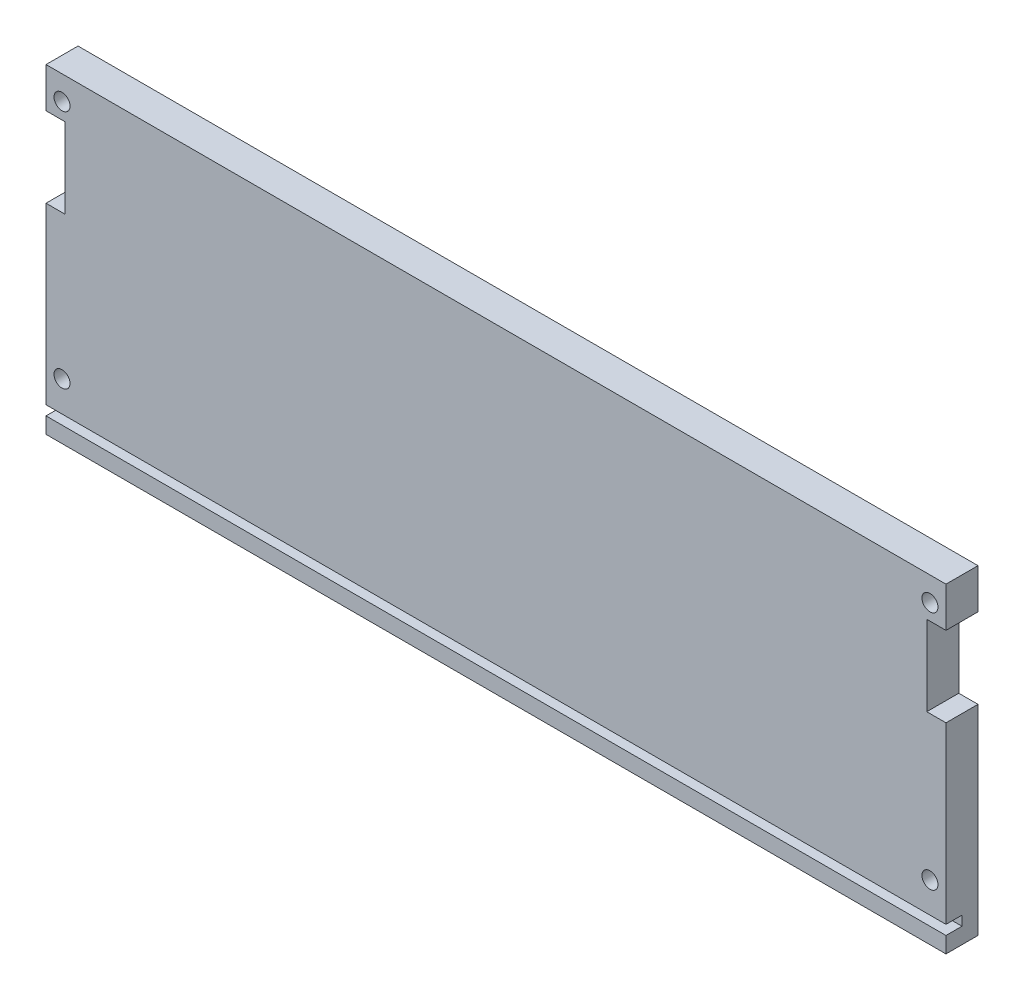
ISO-10303-21;
HEADER;
FILE_DESCRIPTION(('STEP AP214'),'2;1');
FILE_NAME('part.step','',(''),(''),'','','');
FILE_SCHEMA(('AUTOMOTIVE_DESIGN { 1 0 10303 214 1 1 1 1 }'));
ENDSEC;
DATA;
#1=APPLICATION_CONTEXT('core data for automotive mechanical design processes');
#2=APPLICATION_PROTOCOL_DEFINITION('international standard','automotive_design',2000,#1);
#3=PRODUCT_CONTEXT('',#1,'mechanical');
#4=PRODUCT('Part','Part','',(#3));
#5=PRODUCT_RELATED_PRODUCT_CATEGORY('part','',(#4));
#6=PRODUCT_DEFINITION_FORMATION('','',#4);
#7=PRODUCT_DEFINITION_CONTEXT('part definition',#1,'design');
#8=PRODUCT_DEFINITION('design','',#6,#7);
#9=PRODUCT_DEFINITION_SHAPE('','',#8);
#10=(LENGTH_UNIT() NAMED_UNIT(*) SI_UNIT(.MILLI.,.METRE.));
#11=(NAMED_UNIT(*) PLANE_ANGLE_UNIT() SI_UNIT($,.RADIAN.));
#12=(NAMED_UNIT(*) SI_UNIT($,.STERADIAN.) SOLID_ANGLE_UNIT());
#13=UNCERTAINTY_MEASURE_WITH_UNIT(LENGTH_MEASURE(1.E-05),#10,'distance_accuracy_value','');
#14=(GEOMETRIC_REPRESENTATION_CONTEXT(3) GLOBAL_UNCERTAINTY_ASSIGNED_CONTEXT((#13)) GLOBAL_UNIT_ASSIGNED_CONTEXT((#10,
#11,#12)) REPRESENTATION_CONTEXT('',''));
#15=CARTESIAN_POINT('',(0.,0.,0.));
#16=DIRECTION('',(0.,0.,1.));
#17=DIRECTION('',(1.,0.,0.));
#18=AXIS2_PLACEMENT_3D('',#15,#16,#17);
#19=CARTESIAN_POINT('',(140.5,50.,10.));
#20=DIRECTION('',(0.,0.,-1.));
#21=DIRECTION('',(-1.,0.,0.));
#22=AXIS2_PLACEMENT_3D('',#19,#20,#21);
#23=PLANE('',#22);
#24=CARTESIAN_POINT('',(-135.5,-32.5,10.));
#25=DIRECTION('',(0.,0.,1.));
#26=DIRECTION('',(1.,0.,0.));
#27=AXIS2_PLACEMENT_3D('',#24,#25,#26);
#28=CIRCLE('',#27,2.5);
#29=CARTESIAN_POINT('',(-133.,-32.5,10.));
#30=VERTEX_POINT('',#29);
#31=EDGE_CURVE('E237',#30,#30,#28,.T.);
#32=ORIENTED_EDGE('',*,*,#31,.F.);
#33=EDGE_LOOP('',(#32));
#34=FACE_BOUND('',#33,.T.);
#35=CARTESIAN_POINT('',(135.5,-32.5,10.));
#36=DIRECTION('',(0.,0.,1.));
#37=DIRECTION('',(-1.,0.,0.));
#38=AXIS2_PLACEMENT_3D('',#35,#36,#37);
#39=CIRCLE('',#38,2.5);
#40=CARTESIAN_POINT('',(133.,-32.5,10.));
#41=VERTEX_POINT('',#40);
#42=EDGE_CURVE('E231',#41,#41,#39,.T.);
#43=ORIENTED_EDGE('',*,*,#42,.F.);
#44=EDGE_LOOP('',(#43));
#45=FACE_BOUND('',#44,.T.);
#46=CARTESIAN_POINT('',(135.5,42.5,10.));
#47=DIRECTION('',(0.,0.,1.));
#48=DIRECTION('',(1.,0.,0.));
#49=AXIS2_PLACEMENT_3D('',#46,#47,#48);
#50=CIRCLE('',#49,2.5);
#51=CARTESIAN_POINT('',(138.,42.5,10.));
#52=VERTEX_POINT('',#51);
#53=EDGE_CURVE('E225',#52,#52,#50,.T.);
#54=ORIENTED_EDGE('',*,*,#53,.F.);
#55=EDGE_LOOP('',(#54));
#56=FACE_BOUND('',#55,.T.);
#57=CARTESIAN_POINT('',(-135.5,42.5,10.));
#58=DIRECTION('',(0.,0.,1.));
#59=DIRECTION('',(-1.,0.,0.));
#60=AXIS2_PLACEMENT_3D('',#57,#58,#59);
#61=CIRCLE('',#60,2.5);
#62=CARTESIAN_POINT('',(-138.,42.5,10.));
#63=VERTEX_POINT('',#62);
#64=EDGE_CURVE('E216',#63,#63,#61,.T.);
#65=ORIENTED_EDGE('',*,*,#64,.F.);
#66=EDGE_LOOP('',(#65));
#67=FACE_BOUND('',#66,.T.);
#68=DIRECTION('',(0.,-1.,0.));
#69=VECTOR('',#68,1.);
#70=CARTESIAN_POINT('',(-140.5,-50.,10.));
#71=LINE('',#70,#69);
#72=CARTESIAN_POINT('',(-140.5,12.5,10.));
#73=VERTEX_POINT('',#72);
#74=CARTESIAN_POINT('',(-140.5,-42.,10.));
#75=VERTEX_POINT('',#74);
#76=EDGE_CURVE('E257',#73,#75,#71,.T.);
#77=ORIENTED_EDGE('',*,*,#76,.T.);
#78=DIRECTION('',(-1.,0.,0.));
#79=VECTOR('',#78,1.);
#80=CARTESIAN_POINT('',(-140.5,-42.,10.));
#81=LINE('',#80,#79);
#82=CARTESIAN_POINT('',(140.5,-42.,10.));
#83=VERTEX_POINT('',#82);
#84=EDGE_CURVE('E158',#83,#75,#81,.T.);
#85=ORIENTED_EDGE('',*,*,#84,.F.);
#86=DIRECTION('',(0.,1.,0.));
#87=VECTOR('',#86,1.);
#88=CARTESIAN_POINT('',(140.5,-50.,10.));
#89=LINE('',#88,#87);
#90=CARTESIAN_POINT('',(140.5,12.5,10.));
#91=VERTEX_POINT('',#90);
#92=EDGE_CURVE('E250',#83,#91,#89,.T.);
#93=ORIENTED_EDGE('',*,*,#92,.T.);
#94=DIRECTION('',(-1.,0.,0.));
#95=VECTOR('',#94,1.);
#96=CARTESIAN_POINT('',(140.5,12.5,10.));
#97=LINE('',#96,#95);
#98=CARTESIAN_POINT('',(134.5,12.5,10.));
#99=VERTEX_POINT('',#98);
#100=EDGE_CURVE('E196',#91,#99,#97,.T.);
#101=ORIENTED_EDGE('',*,*,#100,.T.);
#102=DIRECTION('',(0.,1.,0.));
#103=VECTOR('',#102,1.);
#104=CARTESIAN_POINT('',(134.5,37.5,10.));
#105=LINE('',#104,#103);
#106=CARTESIAN_POINT('',(134.5,37.5,10.));
#107=VERTEX_POINT('',#106);
#108=EDGE_CURVE('E199',#99,#107,#105,.T.);
#109=ORIENTED_EDGE('',*,*,#108,.T.);
#110=DIRECTION('',(1.,0.,0.));
#111=VECTOR('',#110,1.);
#112=CARTESIAN_POINT('',(140.5,37.5,10.));
#113=LINE('',#112,#111);
#114=CARTESIAN_POINT('',(140.5,37.5,10.));
#115=VERTEX_POINT('',#114);
#116=EDGE_CURVE('E203',#107,#115,#113,.T.);
#117=ORIENTED_EDGE('',*,*,#116,.T.);
#118=CARTESIAN_POINT('',(140.5,50.,10.));
#119=VERTEX_POINT('',#118);
#120=EDGE_CURVE('E251',#115,#119,#89,.T.);
#121=ORIENTED_EDGE('',*,*,#120,.T.);
#122=DIRECTION('',(-1.,0.,0.));
#123=VECTOR('',#122,1.);
#124=CARTESIAN_POINT('',(-140.5,50.,10.));
#125=LINE('',#124,#123);
#126=CARTESIAN_POINT('',(-140.5,50.,10.));
#127=VERTEX_POINT('',#126);
#128=EDGE_CURVE('E249',#119,#127,#125,.T.);
#129=ORIENTED_EDGE('',*,*,#128,.T.);
#130=CARTESIAN_POINT('',(-140.5,37.5,10.));
#131=VERTEX_POINT('',#130);
#132=EDGE_CURVE('E253',#127,#131,#71,.T.);
#133=ORIENTED_EDGE('',*,*,#132,.T.);
#134=DIRECTION('',(1.,0.,0.));
#135=VECTOR('',#134,1.);
#136=CARTESIAN_POINT('',(-140.5,37.5,10.));
#137=LINE('',#136,#135);
#138=CARTESIAN_POINT('',(-134.5,37.5,10.));
#139=VERTEX_POINT('',#138);
#140=EDGE_CURVE('E170',#131,#139,#137,.T.);
#141=ORIENTED_EDGE('',*,*,#140,.T.);
#142=DIRECTION('',(0.,-1.,0.));
#143=VECTOR('',#142,1.);
#144=CARTESIAN_POINT('',(-134.5,37.5,10.));
#145=LINE('',#144,#143);
#146=CARTESIAN_POINT('',(-134.5,12.5,10.));
#147=VERTEX_POINT('',#146);
#148=EDGE_CURVE('E173',#139,#147,#145,.T.);
#149=ORIENTED_EDGE('',*,*,#148,.T.);
#150=DIRECTION('',(-1.,0.,0.));
#151=VECTOR('',#150,1.);
#152=CARTESIAN_POINT('',(-140.5,12.5,10.));
#153=LINE('',#152,#151);
#154=EDGE_CURVE('E177',#147,#73,#153,.T.);
#155=ORIENTED_EDGE('',*,*,#154,.T.);
#156=EDGE_LOOP('',(#77,#85,#93,#101,#109,#117,#121,#129,#133,#141,#149,#155));
#157=FACE_BOUND('',#156,.T.);
#158=ADVANCED_FACE('F30',(#34,#45,#56,#67,#157),#23,.F.);
#159=CARTESIAN_POINT('',(-140.5,-50.,10.));
#160=DIRECTION('',(1.,0.,0.));
#161=DIRECTION('',(0.,0.,-1.));
#162=AXIS2_PLACEMENT_3D('',#159,#160,#161);
#163=PLANE('',#162);
#164=DIRECTION('',(0.,-1.,0.));
#165=VECTOR('',#164,1.);
#166=CARTESIAN_POINT('',(-140.5,-50.,0.));
#167=LINE('',#166,#165);
#168=CARTESIAN_POINT('',(-140.5,50.,0.));
#169=VERTEX_POINT('',#168);
#170=CARTESIAN_POINT('',(-140.5,37.5,0.));
#171=VERTEX_POINT('',#170);
#172=EDGE_CURVE('E266',#169,#171,#167,.T.);
#173=ORIENTED_EDGE('',*,*,#172,.T.);
#174=DIRECTION('',(0.,0.,-1.));
#175=VECTOR('',#174,1.);
#176=CARTESIAN_POINT('',(-140.5,37.5,10.));
#177=LINE('',#176,#175);
#178=EDGE_CURVE('E187',#131,#171,#177,.T.);
#179=ORIENTED_EDGE('',*,*,#178,.F.);
#180=ORIENTED_EDGE('',*,*,#132,.F.);
#181=DIRECTION('',(0.,0.,-1.));
#182=VECTOR('',#181,1.);
#183=CARTESIAN_POINT('',(-140.5,50.,10.));
#184=LINE('',#183,#182);
#185=EDGE_CURVE('E38',#127,#169,#184,.T.);
#186=ORIENTED_EDGE('',*,*,#185,.T.);
#187=EDGE_LOOP('',(#173,#179,#180,#186));
#188=FACE_BOUND('',#187,.T.);
#189=ADVANCED_FACE('F280',(#188),#163,.F.);
#190=CARTESIAN_POINT('',(140.5,-50.,10.));
#191=DIRECTION('',(-1.,0.,0.));
#192=DIRECTION('',(0.,0.,1.));
#193=AXIS2_PLACEMENT_3D('',#190,#191,#192);
#194=PLANE('',#193);
#195=ORIENTED_EDGE('',*,*,#120,.F.);
#196=DIRECTION('',(0.,0.,-1.));
#197=VECTOR('',#196,1.);
#198=CARTESIAN_POINT('',(140.5,37.5,10.));
#199=LINE('',#198,#197);
#200=CARTESIAN_POINT('',(140.5,37.5,0.));
#201=VERTEX_POINT('',#200);
#202=EDGE_CURVE('E213',#115,#201,#199,.T.);
#203=ORIENTED_EDGE('',*,*,#202,.T.);
#204=DIRECTION('',(0.,1.,0.));
#205=VECTOR('',#204,1.);
#206=CARTESIAN_POINT('',(140.5,-50.,0.));
#207=LINE('',#206,#205);
#208=CARTESIAN_POINT('',(140.5,50.,0.));
#209=VERTEX_POINT('',#208);
#210=EDGE_CURVE('E243',#201,#209,#207,.T.);
#211=ORIENTED_EDGE('',*,*,#210,.T.);
#212=DIRECTION('',(0.,0.,-1.));
#213=VECTOR('',#212,1.);
#214=CARTESIAN_POINT('',(140.5,50.,10.));
#215=LINE('',#214,#213);
#216=EDGE_CURVE('E11',#119,#209,#215,.T.);
#217=ORIENTED_EDGE('',*,*,#216,.F.);
#218=EDGE_LOOP('',(#195,#203,#211,#217));
#219=FACE_BOUND('',#218,.T.);
#220=ADVANCED_FACE('F302',(#219),#194,.F.);
#221=ORIENTED_EDGE('',*,*,#92,.F.);
#222=DIRECTION('',(0.,0.,1.));
#223=VECTOR('',#222,1.);
#224=CARTESIAN_POINT('',(140.5,-42.,5.));
#225=LINE('',#224,#223);
#226=CARTESIAN_POINT('',(140.5,-42.,5.));
#227=VERTEX_POINT('',#226);
#228=EDGE_CURVE('E165',#227,#83,#225,.T.);
#229=ORIENTED_EDGE('',*,*,#228,.F.);
#230=DIRECTION('',(0.,1.,0.));
#231=VECTOR('',#230,1.);
#232=CARTESIAN_POINT('',(140.5,-42.,5.));
#233=LINE('',#232,#231);
#234=CARTESIAN_POINT('',(140.5,-45.,5.));
#235=VERTEX_POINT('',#234);
#236=EDGE_CURVE('E148',#235,#227,#233,.T.);
#237=ORIENTED_EDGE('',*,*,#236,.F.);
#238=DIRECTION('',(0.,0.,1.));
#239=VECTOR('',#238,1.);
#240=CARTESIAN_POINT('',(140.5,-45.,5.));
#241=LINE('',#240,#239);
#242=CARTESIAN_POINT('',(140.5,-45.,10.));
#243=VERTEX_POINT('',#242);
#244=EDGE_CURVE('E145',#235,#243,#241,.T.);
#245=ORIENTED_EDGE('',*,*,#244,.T.);
#246=CARTESIAN_POINT('',(140.5,-50.,10.));
#247=VERTEX_POINT('',#246);
#248=EDGE_CURVE('E246',#247,#243,#89,.T.);
#249=ORIENTED_EDGE('',*,*,#248,.F.);
#250=DIRECTION('',(0.,0.,-1.));
#251=VECTOR('',#250,1.);
#252=CARTESIAN_POINT('',(140.5,-50.,10.));
#253=LINE('',#252,#251);
#254=CARTESIAN_POINT('',(140.5,-50.,0.));
#255=VERTEX_POINT('',#254);
#256=EDGE_CURVE('E259',#247,#255,#253,.T.);
#257=ORIENTED_EDGE('',*,*,#256,.T.);
#258=CARTESIAN_POINT('',(140.5,12.5,0.));
#259=VERTEX_POINT('',#258);
#260=EDGE_CURVE('E260',#255,#259,#207,.T.);
#261=ORIENTED_EDGE('',*,*,#260,.T.);
#262=DIRECTION('',(0.,0.,-1.));
#263=VECTOR('',#262,1.);
#264=CARTESIAN_POINT('',(140.5,12.5,10.));
#265=LINE('',#264,#263);
#266=EDGE_CURVE('E206',#91,#259,#265,.T.);
#267=ORIENTED_EDGE('',*,*,#266,.F.);
#268=EDGE_LOOP('',(#221,#229,#237,#245,#249,#257,#261,#267));
#269=FACE_BOUND('',#268,.T.);
#270=ADVANCED_FACE('F32',(#269),#194,.F.);
#271=CARTESIAN_POINT('',(-140.5,50.,10.));
#272=DIRECTION('',(0.,-1.,0.));
#273=DIRECTION('',(0.,0.,-1.));
#274=AXIS2_PLACEMENT_3D('',#271,#272,#273);
#275=PLANE('',#274);
#276=DIRECTION('',(-1.,0.,0.));
#277=VECTOR('',#276,1.);
#278=CARTESIAN_POINT('',(-140.5,50.,0.));
#279=LINE('',#278,#277);
#280=EDGE_CURVE('E263',#209,#169,#279,.T.);
#281=ORIENTED_EDGE('',*,*,#280,.T.);
#282=ORIENTED_EDGE('',*,*,#185,.F.);
#283=ORIENTED_EDGE('',*,*,#128,.F.);
#284=ORIENTED_EDGE('',*,*,#216,.T.);
#285=EDGE_LOOP('',(#281,#282,#283,#284));
#286=FACE_BOUND('',#285,.T.);
#287=ADVANCED_FACE('F300',(#286),#275,.F.);
#288=DIRECTION('',(0.,-1.,0.));
#289=VECTOR('',#288,1.);
#290=CARTESIAN_POINT('',(-140.5,-42.,5.));
#291=LINE('',#290,#289);
#292=CARTESIAN_POINT('',(-140.5,-42.,5.));
#293=VERTEX_POINT('',#292);
#294=CARTESIAN_POINT('',(-140.5,-45.,5.));
#295=VERTEX_POINT('',#294);
#296=EDGE_CURVE('E149',#293,#295,#291,.T.);
#297=ORIENTED_EDGE('',*,*,#296,.F.);
#298=DIRECTION('',(0.,0.,1.));
#299=VECTOR('',#298,1.);
#300=CARTESIAN_POINT('',(-140.5,-42.,5.));
#301=LINE('',#300,#299);
#302=EDGE_CURVE('E183',#293,#75,#301,.T.);
#303=ORIENTED_EDGE('',*,*,#302,.T.);
#304=ORIENTED_EDGE('',*,*,#76,.F.);
#305=DIRECTION('',(0.,0.,-1.));
#306=VECTOR('',#305,1.);
#307=CARTESIAN_POINT('',(-140.5,12.5,10.));
#308=LINE('',#307,#306);
#309=CARTESIAN_POINT('',(-140.5,12.5,0.));
#310=VERTEX_POINT('',#309);
#311=EDGE_CURVE('E190',#73,#310,#308,.T.);
#312=ORIENTED_EDGE('',*,*,#311,.T.);
#313=CARTESIAN_POINT('',(-140.5,-50.,0.));
#314=VERTEX_POINT('',#313);
#315=EDGE_CURVE('E265',#310,#314,#167,.T.);
#316=ORIENTED_EDGE('',*,*,#315,.T.);
#317=DIRECTION('',(0.,0.,-1.));
#318=VECTOR('',#317,1.);
#319=CARTESIAN_POINT('',(-140.5,-50.,10.));
#320=LINE('',#319,#318);
#321=CARTESIAN_POINT('',(-140.5,-50.,10.));
#322=VERTEX_POINT('',#321);
#323=EDGE_CURVE('E273',#322,#314,#320,.T.);
#324=ORIENTED_EDGE('',*,*,#323,.F.);
#325=CARTESIAN_POINT('',(-140.5,-45.,10.));
#326=VERTEX_POINT('',#325);
#327=EDGE_CURVE('E163',#326,#322,#71,.T.);
#328=ORIENTED_EDGE('',*,*,#327,.F.);
#329=DIRECTION('',(0.,0.,1.));
#330=VECTOR('',#329,1.);
#331=CARTESIAN_POINT('',(-140.5,-45.,5.));
#332=LINE('',#331,#330);
#333=EDGE_CURVE('E45',#295,#326,#332,.T.);
#334=ORIENTED_EDGE('',*,*,#333,.F.);
#335=EDGE_LOOP('',(#297,#303,#304,#312,#316,#324,#328,#334));
#336=FACE_BOUND('',#335,.T.);
#337=ADVANCED_FACE('F161',(#336),#163,.F.);
#338=CARTESIAN_POINT('',(-140.5,-50.,10.));
#339=DIRECTION('',(0.,1.,0.));
#340=DIRECTION('',(0.,0.,1.));
#341=AXIS2_PLACEMENT_3D('',#338,#339,#340);
#342=PLANE('',#341);
#343=DIRECTION('',(1.,0.,0.));
#344=VECTOR('',#343,1.);
#345=CARTESIAN_POINT('',(-140.5,-50.,0.));
#346=LINE('',#345,#344);
#347=EDGE_CURVE('E269',#314,#255,#346,.T.);
#348=ORIENTED_EDGE('',*,*,#347,.T.);
#349=ORIENTED_EDGE('',*,*,#256,.F.);
#350=DIRECTION('',(1.,0.,0.));
#351=VECTOR('',#350,1.);
#352=CARTESIAN_POINT('',(-140.5,-50.,10.));
#353=LINE('',#352,#351);
#354=EDGE_CURVE('E256',#322,#247,#353,.T.);
#355=ORIENTED_EDGE('',*,*,#354,.F.);
#356=ORIENTED_EDGE('',*,*,#323,.T.);
#357=EDGE_LOOP('',(#348,#349,#355,#356));
#358=FACE_BOUND('',#357,.T.);
#359=ADVANCED_FACE('F324',(#358),#342,.F.);
#360=ORIENTED_EDGE('',*,*,#248,.T.);
#361=DIRECTION('',(1.,0.,0.));
#362=VECTOR('',#361,1.);
#363=CARTESIAN_POINT('',(-140.5,-45.,10.));
#364=LINE('',#363,#362);
#365=EDGE_CURVE('E331',#326,#243,#364,.T.);
#366=ORIENTED_EDGE('',*,*,#365,.F.);
#367=ORIENTED_EDGE('',*,*,#327,.T.);
#368=ORIENTED_EDGE('',*,*,#354,.T.);
#369=EDGE_LOOP('',(#360,#366,#367,#368));
#370=FACE_BOUND('',#369,.T.);
#371=ADVANCED_FACE('F330',(#370),#23,.F.);
#372=CARTESIAN_POINT('',(140.5,50.,0.));
#373=DIRECTION('',(0.,0.,-1.));
#374=DIRECTION('',(-1.,0.,0.));
#375=AXIS2_PLACEMENT_3D('',#372,#373,#374);
#376=PLANE('',#375);
#377=DIRECTION('',(1.,0.,0.));
#378=VECTOR('',#377,1.);
#379=CARTESIAN_POINT('',(-140.5,37.5,0.));
#380=LINE('',#379,#378);
#381=CARTESIAN_POINT('',(-134.5,37.5,0.));
#382=VERTEX_POINT('',#381);
#383=EDGE_CURVE('E53',#171,#382,#380,.T.);
#384=ORIENTED_EDGE('',*,*,#383,.F.);
#385=ORIENTED_EDGE('',*,*,#172,.F.);
#386=ORIENTED_EDGE('',*,*,#280,.F.);
#387=ORIENTED_EDGE('',*,*,#210,.F.);
#388=DIRECTION('',(1.,0.,0.));
#389=VECTOR('',#388,1.);
#390=CARTESIAN_POINT('',(140.5,37.5,0.));
#391=LINE('',#390,#389);
#392=CARTESIAN_POINT('',(134.5,37.5,0.));
#393=VERTEX_POINT('',#392);
#394=EDGE_CURVE('E200',#393,#201,#391,.T.);
#395=ORIENTED_EDGE('',*,*,#394,.F.);
#396=DIRECTION('',(0.,1.,0.));
#397=VECTOR('',#396,1.);
#398=CARTESIAN_POINT('',(134.5,37.5,0.));
#399=LINE('',#398,#397);
#400=CARTESIAN_POINT('',(134.5,12.5,0.));
#401=VERTEX_POINT('',#400);
#402=EDGE_CURVE('E209',#401,#393,#399,.T.);
#403=ORIENTED_EDGE('',*,*,#402,.F.);
#404=DIRECTION('',(-1.,0.,0.));
#405=VECTOR('',#404,1.);
#406=CARTESIAN_POINT('',(140.5,12.5,0.));
#407=LINE('',#406,#405);
#408=EDGE_CURVE('E189',#259,#401,#407,.T.);
#409=ORIENTED_EDGE('',*,*,#408,.F.);
#410=ORIENTED_EDGE('',*,*,#260,.F.);
#411=ORIENTED_EDGE('',*,*,#347,.F.);
#412=ORIENTED_EDGE('',*,*,#315,.F.);
#413=DIRECTION('',(-1.,0.,0.));
#414=VECTOR('',#413,1.);
#415=CARTESIAN_POINT('',(-140.5,12.5,0.));
#416=LINE('',#415,#414);
#417=CARTESIAN_POINT('',(-134.5,12.5,0.));
#418=VERTEX_POINT('',#417);
#419=EDGE_CURVE('E174',#418,#310,#416,.T.);
#420=ORIENTED_EDGE('',*,*,#419,.F.);
#421=DIRECTION('',(0.,-1.,0.));
#422=VECTOR('',#421,1.);
#423=CARTESIAN_POINT('',(-134.5,37.5,0.));
#424=LINE('',#423,#422);
#425=EDGE_CURVE('E182',#382,#418,#424,.T.);
#426=ORIENTED_EDGE('',*,*,#425,.F.);
#427=EDGE_LOOP('',(#384,#385,#386,#387,#395,#403,#409,#410,#411,#412,#420,#426));
#428=FACE_BOUND('',#427,.T.);
#429=ADVANCED_FACE('F286',(#428),#376,.T.);
#430=CARTESIAN_POINT('',(-135.5,-32.5,5.));
#431=DIRECTION('',(0.,0.,1.));
#432=DIRECTION('',(1.,0.,0.));
#433=AXIS2_PLACEMENT_3D('',#430,#431,#432);
#434=CYLINDRICAL_SURFACE('',#433,2.5);
#435=CARTESIAN_POINT('',(-135.5,-32.5,5.));
#436=DIRECTION('',(0.,0.,1.));
#437=DIRECTION('',(1.,0.,0.));
#438=AXIS2_PLACEMENT_3D('',#435,#436,#437);
#439=CIRCLE('',#438,2.5);
#440=CARTESIAN_POINT('',(-133.,-32.5,5.));
#441=VERTEX_POINT('',#440);
#442=EDGE_CURVE('E240',#441,#441,#439,.T.);
#443=ORIENTED_EDGE('',*,*,#442,.F.);
#444=EDGE_LOOP('',(#443));
#445=FACE_BOUND('',#444,.T.);
#446=ORIENTED_EDGE('',*,*,#31,.T.);
#447=EDGE_LOOP('',(#446));
#448=FACE_BOUND('',#447,.T.);
#449=ADVANCED_FACE('F364',(#445,#448),#434,.F.);
#450=CARTESIAN_POINT('',(-135.5,-32.5,5.));
#451=DIRECTION('',(0.,0.,1.));
#452=DIRECTION('',(1.,0.,0.));
#453=AXIS2_PLACEMENT_3D('',#450,#451,#452);
#454=PLANE('',#453);
#455=ORIENTED_EDGE('',*,*,#442,.T.);
#456=EDGE_LOOP('',(#455));
#457=FACE_BOUND('',#456,.T.);
#458=ADVANCED_FACE('F445',(#457),#454,.T.);
#459=CARTESIAN_POINT('',(135.5,-32.5,5.));
#460=DIRECTION('',(0.,0.,1.));
#461=DIRECTION('',(1.,0.,0.));
#462=AXIS2_PLACEMENT_3D('',#459,#460,#461);
#463=CYLINDRICAL_SURFACE('',#462,2.5);
#464=CARTESIAN_POINT('',(135.5,-32.5,5.));
#465=DIRECTION('',(0.,0.,1.));
#466=DIRECTION('',(-1.,0.,0.));
#467=AXIS2_PLACEMENT_3D('',#464,#465,#466);
#468=CIRCLE('',#467,2.5);
#469=CARTESIAN_POINT('',(133.,-32.5,5.));
#470=VERTEX_POINT('',#469);
#471=EDGE_CURVE('E234',#470,#470,#468,.T.);
#472=ORIENTED_EDGE('',*,*,#471,.F.);
#473=EDGE_LOOP('',(#472));
#474=FACE_BOUND('',#473,.T.);
#475=ORIENTED_EDGE('',*,*,#42,.T.);
#476=EDGE_LOOP('',(#475));
#477=FACE_BOUND('',#476,.T.);
#478=ADVANCED_FACE('F435',(#474,#477),#463,.F.);
#479=CARTESIAN_POINT('',(135.5,-32.5,5.));
#480=DIRECTION('',(0.,0.,-1.));
#481=DIRECTION('',(-1.,0.,0.));
#482=AXIS2_PLACEMENT_3D('',#479,#480,#481);
#483=PLANE('',#482);
#484=ORIENTED_EDGE('',*,*,#471,.T.);
#485=EDGE_LOOP('',(#484));
#486=FACE_BOUND('',#485,.T.);
#487=ADVANCED_FACE('F425',(#486),#483,.F.);
#488=CARTESIAN_POINT('',(135.5,42.5,5.));
#489=DIRECTION('',(0.,0.,1.));
#490=DIRECTION('',(1.,0.,0.));
#491=AXIS2_PLACEMENT_3D('',#488,#489,#490);
#492=CYLINDRICAL_SURFACE('',#491,2.5);
#493=CARTESIAN_POINT('',(135.5,42.5,5.));
#494=DIRECTION('',(0.,0.,1.));
#495=DIRECTION('',(1.,0.,0.));
#496=AXIS2_PLACEMENT_3D('',#493,#494,#495);
#497=CIRCLE('',#496,2.5);
#498=CARTESIAN_POINT('',(138.,42.5,5.));
#499=VERTEX_POINT('',#498);
#500=EDGE_CURVE('E228',#499,#499,#497,.T.);
#501=ORIENTED_EDGE('',*,*,#500,.F.);
#502=EDGE_LOOP('',(#501));
#503=FACE_BOUND('',#502,.T.);
#504=ORIENTED_EDGE('',*,*,#53,.T.);
#505=EDGE_LOOP('',(#504));
#506=FACE_BOUND('',#505,.T.);
#507=ADVANCED_FACE('F415',(#503,#506),#492,.F.);
#508=CARTESIAN_POINT('',(135.5,42.5,5.));
#509=DIRECTION('',(0.,0.,1.));
#510=DIRECTION('',(1.,0.,0.));
#511=AXIS2_PLACEMENT_3D('',#508,#509,#510);
#512=PLANE('',#511);
#513=ORIENTED_EDGE('',*,*,#500,.T.);
#514=EDGE_LOOP('',(#513));
#515=FACE_BOUND('',#514,.T.);
#516=ADVANCED_FACE('F405',(#515),#512,.T.);
#517=CARTESIAN_POINT('',(-135.5,42.5,5.));
#518=DIRECTION('',(0.,0.,1.));
#519=DIRECTION('',(1.,0.,0.));
#520=AXIS2_PLACEMENT_3D('',#517,#518,#519);
#521=CYLINDRICAL_SURFACE('',#520,2.5);
#522=CARTESIAN_POINT('',(-135.5,42.5,5.));
#523=DIRECTION('',(0.,0.,1.));
#524=DIRECTION('',(-1.,0.,0.));
#525=AXIS2_PLACEMENT_3D('',#522,#523,#524);
#526=CIRCLE('',#525,2.5);
#527=CARTESIAN_POINT('',(-138.,42.5,5.));
#528=VERTEX_POINT('',#527);
#529=EDGE_CURVE('E222',#528,#528,#526,.T.);
#530=ORIENTED_EDGE('',*,*,#529,.F.);
#531=EDGE_LOOP('',(#530));
#532=FACE_BOUND('',#531,.T.);
#533=ORIENTED_EDGE('',*,*,#64,.T.);
#534=EDGE_LOOP('',(#533));
#535=FACE_BOUND('',#534,.T.);
#536=ADVANCED_FACE('F394',(#532,#535),#521,.F.);
#537=CARTESIAN_POINT('',(-135.5,42.5,5.));
#538=DIRECTION('',(0.,0.,-1.));
#539=DIRECTION('',(-1.,0.,0.));
#540=AXIS2_PLACEMENT_3D('',#537,#538,#539);
#541=PLANE('',#540);
#542=ORIENTED_EDGE('',*,*,#529,.T.);
#543=EDGE_LOOP('',(#542));
#544=FACE_BOUND('',#543,.T.);
#545=ADVANCED_FACE('F389',(#544),#541,.F.);
#546=CARTESIAN_POINT('',(140.5,37.5,10.));
#547=DIRECTION('',(0.,1.,0.));
#548=DIRECTION('',(0.,0.,1.));
#549=AXIS2_PLACEMENT_3D('',#546,#547,#548);
#550=PLANE('',#549);
#551=ORIENTED_EDGE('',*,*,#394,.T.);
#552=ORIENTED_EDGE('',*,*,#202,.F.);
#553=ORIENTED_EDGE('',*,*,#116,.F.);
#554=DIRECTION('',(0.,0.,-1.));
#555=VECTOR('',#554,1.);
#556=CARTESIAN_POINT('',(134.5,37.5,10.));
#557=LINE('',#556,#555);
#558=EDGE_CURVE('E217',#107,#393,#557,.T.);
#559=ORIENTED_EDGE('',*,*,#558,.T.);
#560=EDGE_LOOP('',(#551,#552,#553,#559));
#561=FACE_BOUND('',#560,.T.);
#562=ADVANCED_FACE('F307',(#561),#550,.F.);
#563=CARTESIAN_POINT('',(134.5,37.5,10.));
#564=DIRECTION('',(-1.,0.,0.));
#565=DIRECTION('',(0.,0.,1.));
#566=AXIS2_PLACEMENT_3D('',#563,#564,#565);
#567=PLANE('',#566);
#568=ORIENTED_EDGE('',*,*,#402,.T.);
#569=ORIENTED_EDGE('',*,*,#558,.F.);
#570=ORIENTED_EDGE('',*,*,#108,.F.);
#571=DIRECTION('',(0.,0.,-1.));
#572=VECTOR('',#571,1.);
#573=CARTESIAN_POINT('',(134.5,12.5,10.));
#574=LINE('',#573,#572);
#575=EDGE_CURVE('E219',#99,#401,#574,.T.);
#576=ORIENTED_EDGE('',*,*,#575,.T.);
#577=EDGE_LOOP('',(#568,#569,#570,#576));
#578=FACE_BOUND('',#577,.T.);
#579=ADVANCED_FACE('F311',(#578),#567,.F.);
#580=CARTESIAN_POINT('',(140.5,12.5,10.));
#581=DIRECTION('',(0.,-1.,0.));
#582=DIRECTION('',(0.,0.,-1.));
#583=AXIS2_PLACEMENT_3D('',#580,#581,#582);
#584=PLANE('',#583);
#585=ORIENTED_EDGE('',*,*,#408,.T.);
#586=ORIENTED_EDGE('',*,*,#575,.F.);
#587=ORIENTED_EDGE('',*,*,#100,.F.);
#588=ORIENTED_EDGE('',*,*,#266,.T.);
#589=EDGE_LOOP('',(#585,#586,#587,#588));
#590=FACE_BOUND('',#589,.T.);
#591=ADVANCED_FACE('F314',(#590),#584,.F.);
#592=CARTESIAN_POINT('',(-140.5,37.5,10.));
#593=DIRECTION('',(0.,1.,0.));
#594=DIRECTION('',(0.,0.,1.));
#595=AXIS2_PLACEMENT_3D('',#592,#593,#594);
#596=PLANE('',#595);
#597=ORIENTED_EDGE('',*,*,#383,.T.);
#598=DIRECTION('',(0.,0.,-1.));
#599=VECTOR('',#598,1.);
#600=CARTESIAN_POINT('',(-134.5,37.5,10.));
#601=LINE('',#600,#599);
#602=EDGE_CURVE('E180',#139,#382,#601,.T.);
#603=ORIENTED_EDGE('',*,*,#602,.F.);
#604=ORIENTED_EDGE('',*,*,#140,.F.);
#605=ORIENTED_EDGE('',*,*,#178,.T.);
#606=EDGE_LOOP('',(#597,#603,#604,#605));
#607=FACE_BOUND('',#606,.T.);
#608=ADVANCED_FACE('F295',(#607),#596,.F.);
#609=CARTESIAN_POINT('',(-140.5,12.5,10.));
#610=DIRECTION('',(0.,-1.,0.));
#611=DIRECTION('',(0.,0.,-1.));
#612=AXIS2_PLACEMENT_3D('',#609,#610,#611);
#613=PLANE('',#612);
#614=ORIENTED_EDGE('',*,*,#419,.T.);
#615=ORIENTED_EDGE('',*,*,#311,.F.);
#616=ORIENTED_EDGE('',*,*,#154,.F.);
#617=DIRECTION('',(0.,0.,-1.));
#618=VECTOR('',#617,1.);
#619=CARTESIAN_POINT('',(-134.5,12.5,10.));
#620=LINE('',#619,#618);
#621=EDGE_CURVE('E193',#147,#418,#620,.T.);
#622=ORIENTED_EDGE('',*,*,#621,.T.);
#623=EDGE_LOOP('',(#614,#615,#616,#622));
#624=FACE_BOUND('',#623,.T.);
#625=ADVANCED_FACE('F327',(#624),#613,.F.);
#626=CARTESIAN_POINT('',(-134.5,37.5,10.));
#627=DIRECTION('',(1.,0.,0.));
#628=DIRECTION('',(0.,0.,-1.));
#629=AXIS2_PLACEMENT_3D('',#626,#627,#628);
#630=PLANE('',#629);
#631=ORIENTED_EDGE('',*,*,#425,.T.);
#632=ORIENTED_EDGE('',*,*,#621,.F.);
#633=ORIENTED_EDGE('',*,*,#148,.F.);
#634=ORIENTED_EDGE('',*,*,#602,.T.);
#635=EDGE_LOOP('',(#631,#632,#633,#634));
#636=FACE_BOUND('',#635,.T.);
#637=ADVANCED_FACE('F292',(#636),#630,.F.);
#638=CARTESIAN_POINT('',(-140.5,-42.,5.));
#639=DIRECTION('',(0.,1.,0.));
#640=DIRECTION('',(0.,0.,1.));
#641=AXIS2_PLACEMENT_3D('',#638,#639,#640);
#642=PLANE('',#641);
#643=ORIENTED_EDGE('',*,*,#84,.T.);
#644=ORIENTED_EDGE('',*,*,#302,.F.);
#645=DIRECTION('',(-1.,0.,0.));
#646=VECTOR('',#645,1.);
#647=CARTESIAN_POINT('',(-140.5,-42.,5.));
#648=LINE('',#647,#646);
#649=EDGE_CURVE('E155',#227,#293,#648,.T.);
#650=ORIENTED_EDGE('',*,*,#649,.F.);
#651=ORIENTED_EDGE('',*,*,#228,.T.);
#652=EDGE_LOOP('',(#643,#644,#650,#651));
#653=FACE_BOUND('',#652,.T.);
#654=ADVANCED_FACE('F338',(#653),#642,.F.);
#655=CARTESIAN_POINT('',(-140.5,-45.,5.));
#656=DIRECTION('',(0.,-1.,0.));
#657=DIRECTION('',(0.,0.,-1.));
#658=AXIS2_PLACEMENT_3D('',#655,#656,#657);
#659=PLANE('',#658);
#660=ORIENTED_EDGE('',*,*,#365,.T.);
#661=ORIENTED_EDGE('',*,*,#244,.F.);
#662=DIRECTION('',(1.,0.,0.));
#663=VECTOR('',#662,1.);
#664=CARTESIAN_POINT('',(-140.5,-45.,5.));
#665=LINE('',#664,#663);
#666=EDGE_CURVE('E141',#295,#235,#665,.T.);
#667=ORIENTED_EDGE('',*,*,#666,.F.);
#668=ORIENTED_EDGE('',*,*,#333,.T.);
#669=EDGE_LOOP('',(#660,#661,#667,#668));
#670=FACE_BOUND('',#669,.T.);
#671=ADVANCED_FACE('F143',(#670),#659,.F.);
#672=CARTESIAN_POINT('',(-140.5,-45.,5.));
#673=DIRECTION('',(0.,0.,1.));
#674=DIRECTION('',(1.,0.,0.));
#675=AXIS2_PLACEMENT_3D('',#672,#673,#674);
#676=PLANE('',#675);
#677=ORIENTED_EDGE('',*,*,#296,.T.);
#678=ORIENTED_EDGE('',*,*,#666,.T.);
#679=ORIENTED_EDGE('',*,*,#236,.T.);
#680=ORIENTED_EDGE('',*,*,#649,.T.);
#681=EDGE_LOOP('',(#677,#678,#679,#680));
#682=FACE_BOUND('',#681,.T.);
#683=ADVANCED_FACE('F153',(#682),#676,.T.);
#684=CLOSED_SHELL('',(#158,#189,#220,#270,#287,#337,#359,#371,#429,#449,#458,#478,#487,#507,
#516,#536,#545,#562,#579,#591,#608,#625,#637,#654,#671,#683));
#685=MANIFOLD_SOLID_BREP('B2',#684);
#686=ADVANCED_BREP_SHAPE_REPRESENTATION('',(#18,#685),#14);
#687=SHAPE_DEFINITION_REPRESENTATION(#9,#686);
ENDSEC;
END-ISO-10303-21;
